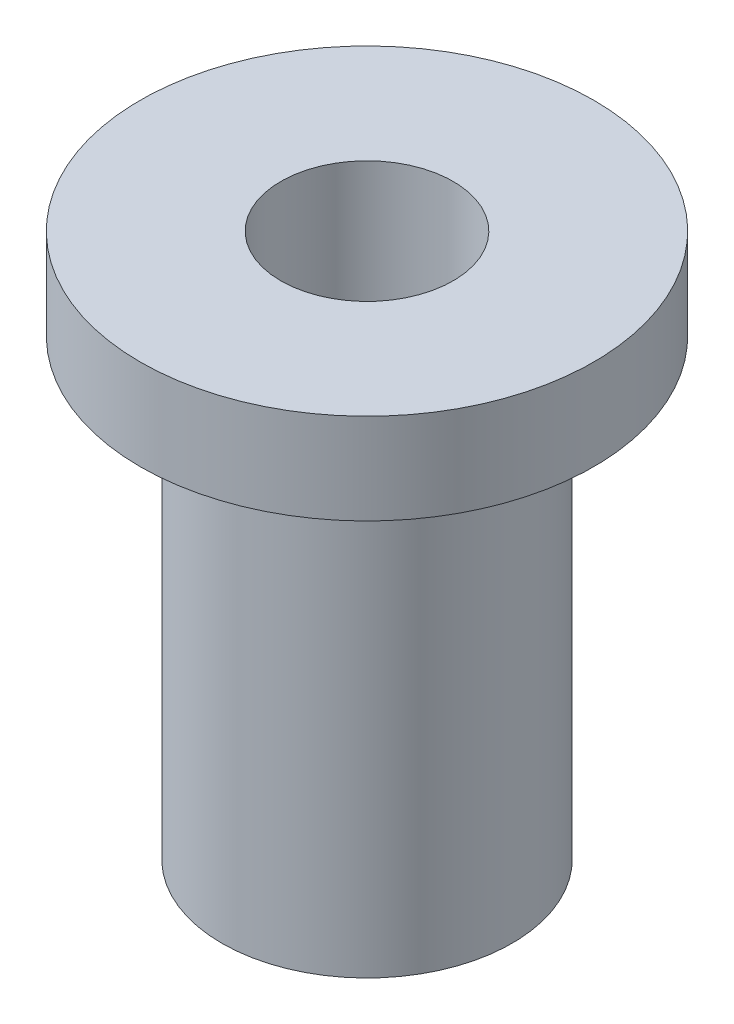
from build123d import *

# Parameters (mm, degrees)
SKETCH2_R           = 12.5
BOSS_EXTRUDE1_DEPTH = 30
SKETCH3_R           = 4.75
CUT_EXTRUDE1_DEPTH  = 30
SKETCH4_OUTSIDE_W   = 36.274
SKETCH4_OUTSIDE_H   = 36.274
SKETCH4_OUTSIDE_R   = 8
CUT_EXTRUDE2_DEPTH  = 25


with BuildPart() as part:
    # Sketch2 → Boss-Extrude1 (new body)
    with BuildSketch(Plane(origin=(0, 0, 0), x_dir=(1, 0, 0), z_dir=(0, 1, 0))):
        with Locations(Location((-11.674216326, 13.796801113, 0), (0, 0, 270))):
            Circle(SKETCH2_R)
    extrude(amount=BOSS_EXTRUDE1_DEPTH)

    # Sketch3 → Cut-Extrude1 (cut)
    with BuildSketch(Plane(origin=(0, 30, 0), x_dir=(1, 0, 0), z_dir=(0, 1, 0))):
        with Locations(Location((-11.674216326, 13.796801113, 0), (0, 0, 270))):
            Circle(SKETCH3_R)
    extrude(amount=-CUT_EXTRUDE1_DEPTH, mode=Mode.SUBTRACT)

    # Sketch4 outside → Cut-Extrude2 (cut)
    with BuildSketch(Plane(origin=(0, 0, 0), x_dir=(-1, 0, 0), z_dir=(0, -1, 0))):
        with Locations((11.674, 13.797)):
            Rectangle(SKETCH4_OUTSIDE_W, SKETCH4_OUTSIDE_H)
        with Locations(Location((11.674216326, 13.796801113, 0), (0, 0, 90))):
            Circle(SKETCH4_OUTSIDE_R, mode=Mode.SUBTRACT)
    extrude(amount=-CUT_EXTRUDE2_DEPTH, mode=Mode.SUBTRACT)


solid = part.part
